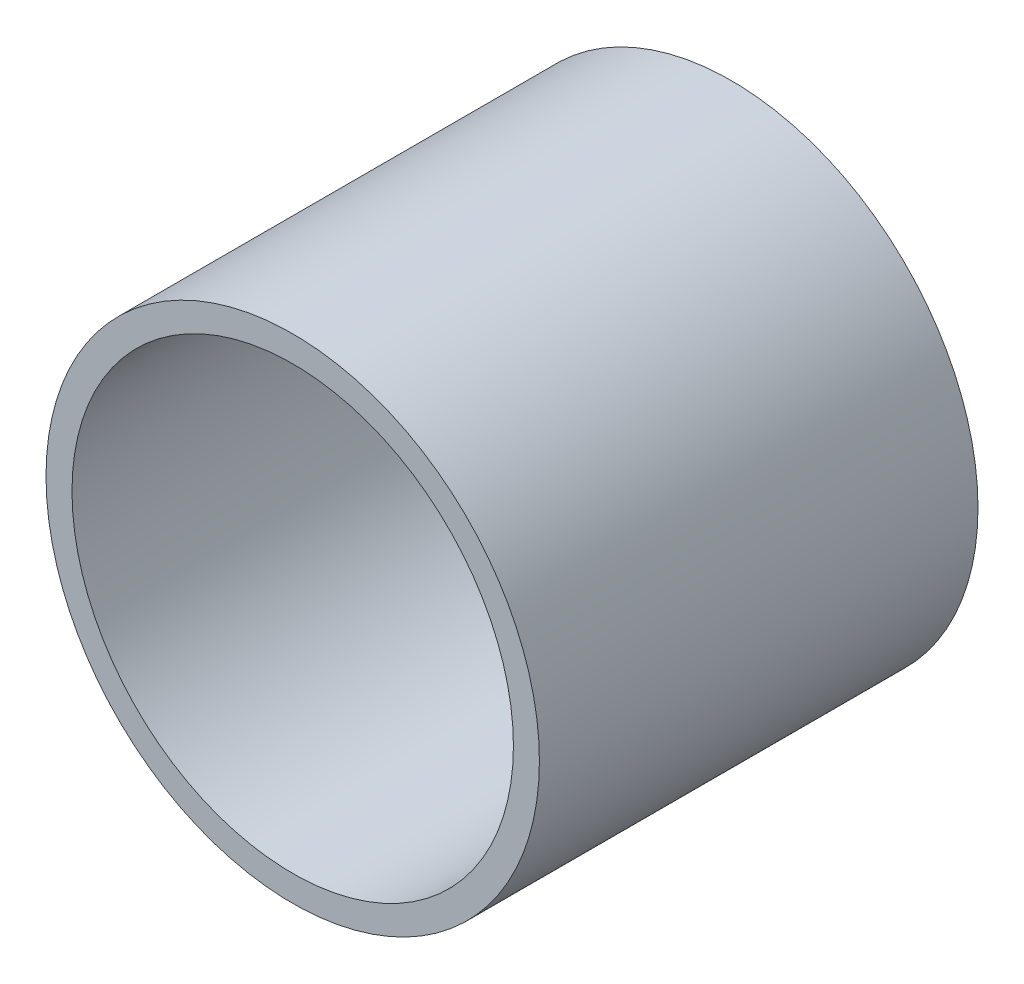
from build123d import *

# Parameters (mm, degrees)
SKETCH1_R      = 57.15
SKETCH1_R_2    = 51.1302
BASEPIPE_DEPTH = 50.8


with BuildPart() as part:
    # Sketch1 → BasePipe (new, symmetric)
    with BuildSketch(Plane.XY):
        Circle(SKETCH1_R)
        Circle(SKETCH1_R_2, mode=Mode.SUBTRACT)
    extrude(amount=BASEPIPE_DEPTH, both=True)


solid = part.part
